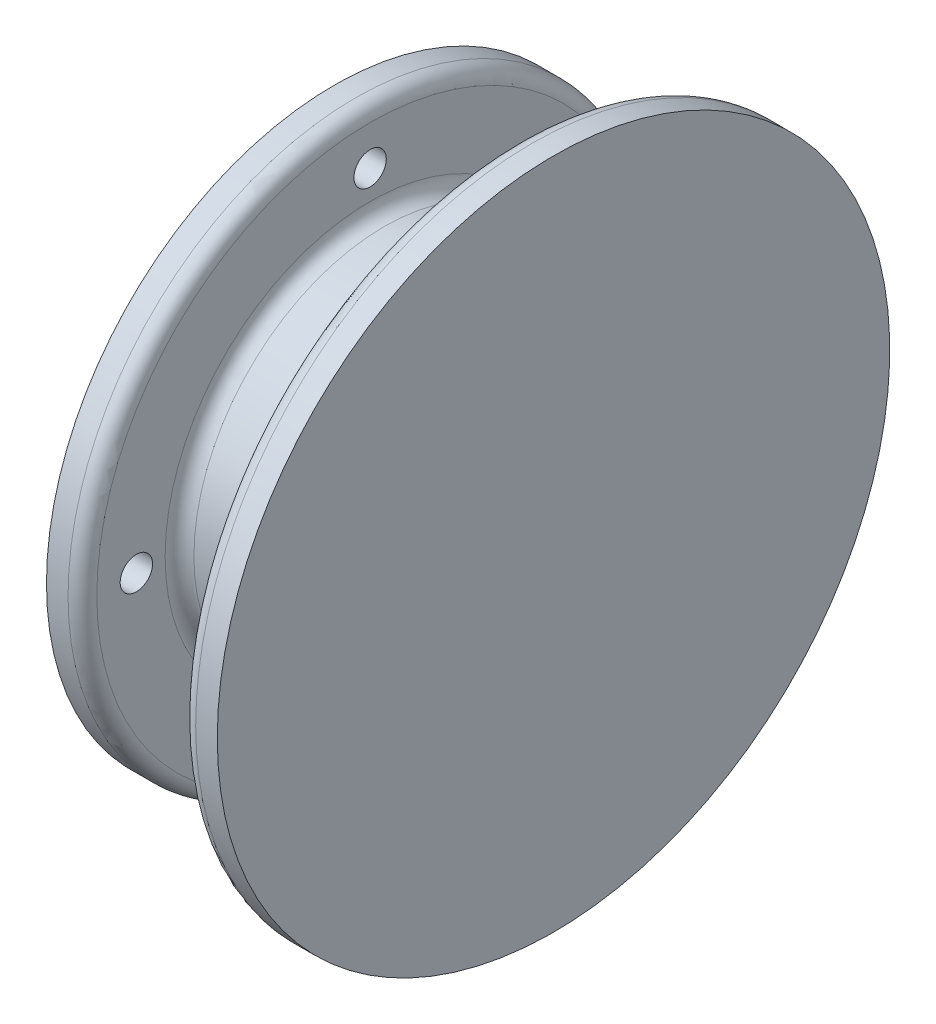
ISO-10303-21;
HEADER;
FILE_DESCRIPTION(('STEP AP214'),'2;1');
FILE_NAME('part.step','',(''),(''),'','','');
FILE_SCHEMA(('AUTOMOTIVE_DESIGN { 1 0 10303 214 1 1 1 1 }'));
ENDSEC;
DATA;
#1=APPLICATION_CONTEXT('core data for automotive mechanical design processes');
#2=APPLICATION_PROTOCOL_DEFINITION('international standard','automotive_design',2000,#1);
#3=PRODUCT_CONTEXT('',#1,'mechanical');
#4=PRODUCT('Part','Part','',(#3));
#5=PRODUCT_RELATED_PRODUCT_CATEGORY('part','',(#4));
#6=PRODUCT_DEFINITION_FORMATION('','',#4);
#7=PRODUCT_DEFINITION_CONTEXT('part definition',#1,'design');
#8=PRODUCT_DEFINITION('design','',#6,#7);
#9=PRODUCT_DEFINITION_SHAPE('','',#8);
#10=(LENGTH_UNIT() NAMED_UNIT(*) SI_UNIT(.MILLI.,.METRE.));
#11=(NAMED_UNIT(*) PLANE_ANGLE_UNIT() SI_UNIT($,.RADIAN.));
#12=(NAMED_UNIT(*) SI_UNIT($,.STERADIAN.) SOLID_ANGLE_UNIT());
#13=UNCERTAINTY_MEASURE_WITH_UNIT(LENGTH_MEASURE(1.E-05),#10,'distance_accuracy_value','');
#14=(GEOMETRIC_REPRESENTATION_CONTEXT(3) GLOBAL_UNCERTAINTY_ASSIGNED_CONTEXT((#13)) GLOBAL_UNIT_ASSIGNED_CONTEXT((#10,
#11,#12)) REPRESENTATION_CONTEXT('',''));
#15=CARTESIAN_POINT('',(0.,0.,0.));
#16=DIRECTION('',(0.,0.,1.));
#17=DIRECTION('',(1.,0.,0.));
#18=AXIS2_PLACEMENT_3D('',#15,#16,#17);
#19=CARTESIAN_POINT('',(240.,86.5,-20.));
#20=DIRECTION('',(1.,0.,0.));
#21=DIRECTION('',(0.,0.,-1.));
#22=AXIS2_PLACEMENT_3D('',#19,#20,#21);
#23=PLANE('',#22);
#24=CARTESIAN_POINT('',(240.,86.5,-20.));
#25=DIRECTION('',(-1.,0.,0.));
#26=DIRECTION('',(0.,0.,1.));
#27=AXIS2_PLACEMENT_3D('',#24,#25,#26);
#28=CIRCLE('',#27,93.5);
#29=CARTESIAN_POINT('',(240.,86.5,73.5));
#30=VERTEX_POINT('',#29);
#31=EDGE_CURVE('E87',#30,#30,#28,.T.);
#32=ORIENTED_EDGE('',*,*,#31,.F.);
#33=EDGE_LOOP('',(#32));
#34=FACE_BOUND('',#33,.T.);
#35=ADVANCED_FACE('F14',(#34),#23,.T.);
#36=CARTESIAN_POINT('',(240.,86.5,-20.));
#37=DIRECTION('',(-1.,0.,0.));
#38=DIRECTION('',(0.,0.,1.));
#39=AXIS2_PLACEMENT_3D('',#36,#37,#38);
#40=CYLINDRICAL_SURFACE('',#39,93.5);
#41=CARTESIAN_POINT('',(234.,86.5,-20.));
#42=DIRECTION('',(-1.,0.,0.));
#43=DIRECTION('',(0.,1.,0.));
#44=AXIS2_PLACEMENT_3D('',#41,#42,#43);
#45=CIRCLE('',#44,93.5);
#46=CARTESIAN_POINT('',(234.,180.,-20.));
#47=VERTEX_POINT('',#46);
#48=EDGE_CURVE('E89',#47,#47,#45,.T.);
#49=ORIENTED_EDGE('',*,*,#48,.F.);
#50=EDGE_LOOP('',(#49));
#51=FACE_BOUND('',#50,.T.);
#52=ORIENTED_EDGE('',*,*,#31,.T.);
#53=EDGE_LOOP('',(#52));
#54=FACE_BOUND('',#53,.T.);
#55=ADVANCED_FACE('F184',(#51,#54),#40,.T.);
#56=CARTESIAN_POINT('',(234.,86.5,-20.));
#57=DIRECTION('',(-1.,0.,0.));
#58=DIRECTION('',(0.,1.,0.));
#59=AXIS2_PLACEMENT_3D('',#56,#57,#58);
#60=TOROIDAL_SURFACE('',#59,89.5,4.);
#61=CARTESIAN_POINT('',(230.,86.5,-20.));
#62=DIRECTION('',(1.,0.,0.));
#63=DIRECTION('',(0.,0.,1.));
#64=AXIS2_PLACEMENT_3D('',#61,#62,#63);
#65=CIRCLE('',#64,89.5000000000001);
#66=CARTESIAN_POINT('',(230.,86.5,69.5000000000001));
#67=VERTEX_POINT('',#66);
#68=EDGE_CURVE('E93',#67,#67,#65,.F.);
#69=ORIENTED_EDGE('',*,*,#68,.F.);
#70=EDGE_LOOP('',(#69));
#71=FACE_BOUND('',#70,.T.);
#72=ORIENTED_EDGE('',*,*,#48,.T.);
#73=EDGE_LOOP('',(#72));
#74=FACE_BOUND('',#73,.T.);
#75=ADVANCED_FACE('F123',(#71,#74),#60,.T.);
#76=CARTESIAN_POINT('',(230.,86.5,-20.));
#77=DIRECTION('',(-1.,0.,0.));
#78=DIRECTION('',(0.,0.,1.));
#79=AXIS2_PLACEMENT_3D('',#76,#77,#78);
#80=PLANE('',#79);
#81=ORIENTED_EDGE('',*,*,#68,.T.);
#82=EDGE_LOOP('',(#81));
#83=FACE_BOUND('',#82,.T.);
#84=CARTESIAN_POINT('',(230.,86.5,-20.));
#85=DIRECTION('',(-1.,0.,0.));
#86=DIRECTION('',(0.,0.,1.));
#87=AXIS2_PLACEMENT_3D('',#84,#85,#86);
#88=CIRCLE('',#87,57.);
#89=CARTESIAN_POINT('',(230.,86.5,37.));
#90=VERTEX_POINT('',#89);
#91=EDGE_CURVE('E98',#90,#90,#88,.F.);
#92=ORIENTED_EDGE('',*,*,#91,.T.);
#93=EDGE_LOOP('',(#92));
#94=FACE_BOUND('',#93,.T.);
#95=ADVANCED_FACE('F113',(#83,#94),#80,.T.);
#96=CARTESIAN_POINT('',(226.,86.5,-20.));
#97=DIRECTION('',(-1.,0.,0.));
#98=DIRECTION('',(0.,1.,0.));
#99=AXIS2_PLACEMENT_3D('',#96,#97,#98);
#100=TOROIDAL_SURFACE('',#99,57.,4.);
#101=ORIENTED_EDGE('',*,*,#91,.F.);
#102=EDGE_LOOP('',(#101));
#103=FACE_BOUND('',#102,.T.);
#104=CARTESIAN_POINT('',(226.,86.5,-20.));
#105=DIRECTION('',(-1.,0.,0.));
#106=DIRECTION('',(0.,0.,1.));
#107=AXIS2_PLACEMENT_3D('',#104,#105,#106);
#108=CIRCLE('',#107,53.);
#109=CARTESIAN_POINT('',(226.,86.5,33.));
#110=VERTEX_POINT('',#109);
#111=EDGE_CURVE('E85',#110,#110,#108,.T.);
#112=ORIENTED_EDGE('',*,*,#111,.F.);
#113=EDGE_LOOP('',(#112));
#114=FACE_BOUND('',#113,.T.);
#115=ADVANCED_FACE('F122',(#103,#114),#100,.F.);
#116=CARTESIAN_POINT('',(175.5,86.5,-20.));
#117=DIRECTION('',(-1.,0.,0.));
#118=DIRECTION('',(0.,0.,1.));
#119=AXIS2_PLACEMENT_3D('',#116,#117,#118);
#120=PLANE('',#119);
#121=CARTESIAN_POINT('',(175.5,86.5,-20.));
#122=DIRECTION('',(-1.,0.,0.));
#123=DIRECTION('',(0.,0.,1.));
#124=AXIS2_PLACEMENT_3D('',#121,#122,#123);
#125=CIRCLE('',#124,55.);
#126=CARTESIAN_POINT('',(175.5,86.5,35.));
#127=VERTEX_POINT('',#126);
#128=EDGE_CURVE('E81',#127,#127,#125,.F.);
#129=ORIENTED_EDGE('',*,*,#128,.F.);
#130=EDGE_LOOP('',(#129));
#131=FACE_BOUND('',#130,.T.);
#132=ADVANCED_FACE('F260',(#131),#120,.T.);
#133=CARTESIAN_POINT('',(226.,86.5,-20.));
#134=DIRECTION('',(-1.,0.,0.));
#135=DIRECTION('',(0.,0.,1.));
#136=AXIS2_PLACEMENT_3D('',#133,#134,#135);
#137=CYLINDRICAL_SURFACE('',#136,53.);
#138=CARTESIAN_POINT('',(193.,86.5,-20.));
#139=DIRECTION('',(-1.,0.,0.));
#140=DIRECTION('',(0.,1.,0.));
#141=AXIS2_PLACEMENT_3D('',#138,#139,#140);
#142=CIRCLE('',#141,53.);
#143=CARTESIAN_POINT('',(193.,139.5,-20.));
#144=VERTEX_POINT('',#143);
#145=EDGE_CURVE('E84',#144,#144,#142,.F.);
#146=ORIENTED_EDGE('',*,*,#145,.T.);
#147=EDGE_LOOP('',(#146));
#148=FACE_BOUND('',#147,.T.);
#149=ORIENTED_EDGE('',*,*,#111,.T.);
#150=EDGE_LOOP('',(#149));
#151=FACE_BOUND('',#150,.T.);
#152=ADVANCED_FACE('F257',(#148,#151),#137,.T.);
#153=CARTESIAN_POINT('',(179.,86.5,-20.));
#154=DIRECTION('',(-1.,0.,0.));
#155=DIRECTION('',(0.,0.,1.));
#156=AXIS2_PLACEMENT_3D('',#153,#154,#155);
#157=CYLINDRICAL_SURFACE('',#156,55.);
#158=ORIENTED_EDGE('',*,*,#128,.T.);
#159=EDGE_LOOP('',(#158));
#160=FACE_BOUND('',#159,.T.);
#161=CARTESIAN_POINT('',(179.,86.5,-20.));
#162=DIRECTION('',(-1.,0.,0.));
#163=DIRECTION('',(0.,0.,1.));
#164=AXIS2_PLACEMENT_3D('',#161,#162,#163);
#165=CIRCLE('',#164,55.);
#166=CARTESIAN_POINT('',(179.,86.5,35.));
#167=VERTEX_POINT('',#166);
#168=EDGE_CURVE('E58',#167,#167,#165,.F.);
#169=ORIENTED_EDGE('',*,*,#168,.F.);
#170=EDGE_LOOP('',(#169));
#171=FACE_BOUND('',#170,.T.);
#172=ADVANCED_FACE('F251',(#160,#171),#157,.T.);
#173=CARTESIAN_POINT('',(185.,86.5,-20.));
#174=DIRECTION('',(-1.,0.,0.));
#175=DIRECTION('',(0.,0.,1.));
#176=AXIS2_PLACEMENT_3D('',#173,#174,#175);
#177=CYLINDRICAL_SURFACE('',#176,80.);
#178=CARTESIAN_POINT('',(179.,86.5,-20.));
#179=DIRECTION('',(-1.,0.,0.));
#180=DIRECTION('',(0.,0.,1.));
#181=AXIS2_PLACEMENT_3D('',#178,#179,#180);
#182=CIRCLE('',#181,80.);
#183=CARTESIAN_POINT('',(179.,86.5,60.));
#184=VERTEX_POINT('',#183);
#185=EDGE_CURVE('E53',#184,#184,#182,.T.);
#186=ORIENTED_EDGE('',*,*,#185,.F.);
#187=EDGE_LOOP('',(#186));
#188=FACE_BOUND('',#187,.T.);
#189=CARTESIAN_POINT('',(185.,86.5,-20.));
#190=DIRECTION('',(-1.,0.,0.));
#191=DIRECTION('',(0.,1.,0.));
#192=AXIS2_PLACEMENT_3D('',#189,#190,#191);
#193=CIRCLE('',#192,80.);
#194=CARTESIAN_POINT('',(185.,166.5,-20.));
#195=VERTEX_POINT('',#194);
#196=EDGE_CURVE('E78',#195,#195,#193,.F.);
#197=ORIENTED_EDGE('',*,*,#196,.F.);
#198=EDGE_LOOP('',(#197));
#199=FACE_BOUND('',#198,.T.);
#200=ADVANCED_FACE('F242',(#188,#199),#177,.T.);
#201=CARTESIAN_POINT('',(179.,86.5,-85.));
#202=DIRECTION('',(1.,0.,0.));
#203=DIRECTION('',(0.,0.,-1.));
#204=AXIS2_PLACEMENT_3D('',#201,#202,#203);
#205=CYLINDRICAL_SURFACE('',#204,4.5);
#206=CARTESIAN_POINT('',(189.,86.5,-85.));
#207=DIRECTION('',(1.,0.,0.));
#208=DIRECTION('',(0.,0.,-1.));
#209=AXIS2_PLACEMENT_3D('',#206,#207,#208);
#210=CIRCLE('',#209,4.5);
#211=CARTESIAN_POINT('',(189.,86.5,-89.5));
#212=VERTEX_POINT('',#211);
#213=EDGE_CURVE('E48',#212,#212,#210,.F.);
#214=ORIENTED_EDGE('',*,*,#213,.F.);
#215=EDGE_LOOP('',(#214));
#216=FACE_BOUND('',#215,.T.);
#217=CARTESIAN_POINT('',(179.,86.5,-85.));
#218=DIRECTION('',(1.,0.,0.));
#219=DIRECTION('',(0.,0.,-1.));
#220=AXIS2_PLACEMENT_3D('',#217,#218,#219);
#221=CIRCLE('',#220,4.5);
#222=CARTESIAN_POINT('',(179.,86.5,-89.5));
#223=VERTEX_POINT('',#222);
#224=EDGE_CURVE('E73',#223,#223,#221,.T.);
#225=ORIENTED_EDGE('',*,*,#224,.F.);
#226=EDGE_LOOP('',(#225));
#227=FACE_BOUND('',#226,.T.);
#228=ADVANCED_FACE('F238',(#216,#227),#205,.F.);
#229=CARTESIAN_POINT('',(179.,151.5,-20.));
#230=DIRECTION('',(1.,0.,0.));
#231=DIRECTION('',(0.,0.,-1.));
#232=AXIS2_PLACEMENT_3D('',#229,#230,#231);
#233=CYLINDRICAL_SURFACE('',#232,4.5);
#234=CARTESIAN_POINT('',(189.,151.5,-20.));
#235=DIRECTION('',(1.,0.,0.));
#236=DIRECTION('',(0.,0.,-1.));
#237=AXIS2_PLACEMENT_3D('',#234,#235,#236);
#238=CIRCLE('',#237,4.5);
#239=CARTESIAN_POINT('',(189.,151.5,-24.5));
#240=VERTEX_POINT('',#239);
#241=EDGE_CURVE('E43',#240,#240,#238,.F.);
#242=ORIENTED_EDGE('',*,*,#241,.F.);
#243=EDGE_LOOP('',(#242));
#244=FACE_BOUND('',#243,.T.);
#245=CARTESIAN_POINT('',(179.,151.5,-20.));
#246=DIRECTION('',(1.,0.,0.));
#247=DIRECTION('',(0.,0.,-1.));
#248=AXIS2_PLACEMENT_3D('',#245,#246,#247);
#249=CIRCLE('',#248,4.5);
#250=CARTESIAN_POINT('',(179.,151.5,-24.5));
#251=VERTEX_POINT('',#250);
#252=EDGE_CURVE('E68',#251,#251,#249,.T.);
#253=ORIENTED_EDGE('',*,*,#252,.F.);
#254=EDGE_LOOP('',(#253));
#255=FACE_BOUND('',#254,.T.);
#256=ADVANCED_FACE('F241',(#244,#255),#233,.F.);
#257=CARTESIAN_POINT('',(179.,86.5,45.));
#258=DIRECTION('',(1.,0.,0.));
#259=DIRECTION('',(0.,0.,-1.));
#260=AXIS2_PLACEMENT_3D('',#257,#258,#259);
#261=CYLINDRICAL_SURFACE('',#260,4.5);
#262=CARTESIAN_POINT('',(189.,86.5,45.));
#263=DIRECTION('',(1.,0.,0.));
#264=DIRECTION('',(0.,0.,-1.));
#265=AXIS2_PLACEMENT_3D('',#262,#263,#264);
#266=CIRCLE('',#265,4.5);
#267=CARTESIAN_POINT('',(189.,86.5,40.5));
#268=VERTEX_POINT('',#267);
#269=EDGE_CURVE('E39',#268,#268,#266,.F.);
#270=ORIENTED_EDGE('',*,*,#269,.F.);
#271=EDGE_LOOP('',(#270));
#272=FACE_BOUND('',#271,.T.);
#273=CARTESIAN_POINT('',(179.,86.5,45.));
#274=DIRECTION('',(1.,0.,0.));
#275=DIRECTION('',(0.,0.,-1.));
#276=AXIS2_PLACEMENT_3D('',#273,#274,#275);
#277=CIRCLE('',#276,4.5);
#278=CARTESIAN_POINT('',(179.,86.5,40.5));
#279=VERTEX_POINT('',#278);
#280=EDGE_CURVE('E63',#279,#279,#277,.T.);
#281=ORIENTED_EDGE('',*,*,#280,.F.);
#282=EDGE_LOOP('',(#281));
#283=FACE_BOUND('',#282,.T.);
#284=ADVANCED_FACE('F154',(#272,#283),#261,.F.);
#285=CARTESIAN_POINT('',(193.,86.5,-20.));
#286=DIRECTION('',(-1.,0.,0.));
#287=DIRECTION('',(0.,1.,0.));
#288=AXIS2_PLACEMENT_3D('',#285,#286,#287);
#289=TOROIDAL_SURFACE('',#288,57.,4.);
#290=ORIENTED_EDGE('',*,*,#145,.F.);
#291=EDGE_LOOP('',(#290));
#292=FACE_BOUND('',#291,.T.);
#293=CARTESIAN_POINT('',(189.,86.5,-20.));
#294=DIRECTION('',(1.,0.,0.));
#295=DIRECTION('',(0.,0.,1.));
#296=AXIS2_PLACEMENT_3D('',#293,#294,#295);
#297=CIRCLE('',#296,57.);
#298=CARTESIAN_POINT('',(189.,86.5,37.));
#299=VERTEX_POINT('',#298);
#300=EDGE_CURVE('E42',#299,#299,#297,.F.);
#301=ORIENTED_EDGE('',*,*,#300,.F.);
#302=EDGE_LOOP('',(#301));
#303=FACE_BOUND('',#302,.T.);
#304=ADVANCED_FACE('F148',(#292,#303),#289,.F.);
#305=CARTESIAN_POINT('',(185.,86.5,-20.));
#306=DIRECTION('',(-1.,0.,0.));
#307=DIRECTION('',(0.,1.,0.));
#308=AXIS2_PLACEMENT_3D('',#305,#306,#307);
#309=TOROIDAL_SURFACE('',#308,76.,4.);
#310=ORIENTED_EDGE('',*,*,#196,.T.);
#311=EDGE_LOOP('',(#310));
#312=FACE_BOUND('',#311,.T.);
#313=CARTESIAN_POINT('',(189.,86.5,-20.));
#314=DIRECTION('',(-1.,0.,0.));
#315=DIRECTION('',(0.,0.,1.));
#316=AXIS2_PLACEMENT_3D('',#313,#314,#315);
#317=CIRCLE('',#316,76.);
#318=CARTESIAN_POINT('',(189.,86.5,56.));
#319=VERTEX_POINT('',#318);
#320=EDGE_CURVE('E27',#319,#319,#317,.F.);
#321=ORIENTED_EDGE('',*,*,#320,.F.);
#322=EDGE_LOOP('',(#321));
#323=FACE_BOUND('',#322,.T.);
#324=ADVANCED_FACE('F153',(#312,#323),#309,.T.);
#325=CARTESIAN_POINT('',(179.,86.5,-20.));
#326=DIRECTION('',(-1.,0.,0.));
#327=DIRECTION('',(0.,0.,1.));
#328=AXIS2_PLACEMENT_3D('',#325,#326,#327);
#329=PLANE('',#328);
#330=ORIENTED_EDGE('',*,*,#185,.T.);
#331=EDGE_LOOP('',(#330));
#332=FACE_BOUND('',#331,.T.);
#333=ORIENTED_EDGE('',*,*,#168,.T.);
#334=EDGE_LOOP('',(#333));
#335=FACE_BOUND('',#334,.T.);
#336=ORIENTED_EDGE('',*,*,#280,.T.);
#337=EDGE_LOOP('',(#336));
#338=FACE_BOUND('',#337,.T.);
#339=ORIENTED_EDGE('',*,*,#252,.T.);
#340=EDGE_LOOP('',(#339));
#341=FACE_BOUND('',#340,.T.);
#342=ORIENTED_EDGE('',*,*,#224,.T.);
#343=EDGE_LOOP('',(#342));
#344=FACE_BOUND('',#343,.T.);
#345=CARTESIAN_POINT('',(179.,21.5,-20.));
#346=DIRECTION('',(1.,0.,0.));
#347=DIRECTION('',(0.,0.,-1.));
#348=AXIS2_PLACEMENT_3D('',#345,#346,#347);
#349=CIRCLE('',#348,4.5);
#350=CARTESIAN_POINT('',(179.,21.5,-24.5));
#351=VERTEX_POINT('',#350);
#352=EDGE_CURVE('E22',#351,#351,#349,.T.);
#353=ORIENTED_EDGE('',*,*,#352,.T.);
#354=EDGE_LOOP('',(#353));
#355=FACE_BOUND('',#354,.T.);
#356=ADVANCED_FACE('F196',(#332,#335,#338,#341,#344,#355),#329,.T.);
#357=CARTESIAN_POINT('',(189.,86.5,-20.));
#358=DIRECTION('',(1.,0.,0.));
#359=DIRECTION('',(0.,0.,-1.));
#360=AXIS2_PLACEMENT_3D('',#357,#358,#359);
#361=PLANE('',#360);
#362=ORIENTED_EDGE('',*,*,#320,.T.);
#363=EDGE_LOOP('',(#362));
#364=FACE_BOUND('',#363,.T.);
#365=ORIENTED_EDGE('',*,*,#300,.T.);
#366=EDGE_LOOP('',(#365));
#367=FACE_BOUND('',#366,.T.);
#368=ORIENTED_EDGE('',*,*,#269,.T.);
#369=EDGE_LOOP('',(#368));
#370=FACE_BOUND('',#369,.T.);
#371=ORIENTED_EDGE('',*,*,#241,.T.);
#372=EDGE_LOOP('',(#371));
#373=FACE_BOUND('',#372,.T.);
#374=ORIENTED_EDGE('',*,*,#213,.T.);
#375=EDGE_LOOP('',(#374));
#376=FACE_BOUND('',#375,.T.);
#377=CARTESIAN_POINT('',(189.,21.5,-20.));
#378=DIRECTION('',(1.,0.,0.));
#379=DIRECTION('',(0.,0.,-1.));
#380=AXIS2_PLACEMENT_3D('',#377,#378,#379);
#381=CIRCLE('',#380,4.5);
#382=CARTESIAN_POINT('',(189.,21.5,-24.5));
#383=VERTEX_POINT('',#382);
#384=EDGE_CURVE('E10',#383,#383,#381,.F.);
#385=ORIENTED_EDGE('',*,*,#384,.T.);
#386=EDGE_LOOP('',(#385));
#387=FACE_BOUND('',#386,.T.);
#388=ADVANCED_FACE('F191',(#364,#367,#370,#373,#376,#387),#361,.T.);
#389=CARTESIAN_POINT('',(179.,21.5,-20.));
#390=DIRECTION('',(1.,0.,0.));
#391=DIRECTION('',(0.,0.,-1.));
#392=AXIS2_PLACEMENT_3D('',#389,#390,#391);
#393=CYLINDRICAL_SURFACE('',#392,4.5);
#394=ORIENTED_EDGE('',*,*,#384,.F.);
#395=EDGE_LOOP('',(#394));
#396=FACE_BOUND('',#395,.T.);
#397=ORIENTED_EDGE('',*,*,#352,.F.);
#398=EDGE_LOOP('',(#397));
#399=FACE_BOUND('',#398,.T.);
#400=ADVANCED_FACE('F16',(#396,#399),#393,.F.);
#401=CLOSED_SHELL('',(#35,#55,#75,#95,#115,#132,#152,#172,#200,#228,#256,#284,#304,#324,#356,
#388,#400));
#402=MANIFOLD_SOLID_BREP('B1',#401);
#403=ADVANCED_BREP_SHAPE_REPRESENTATION('',(#18,#402),#14);
#404=SHAPE_DEFINITION_REPRESENTATION(#9,#403);
ENDSEC;
END-ISO-10303-21;
